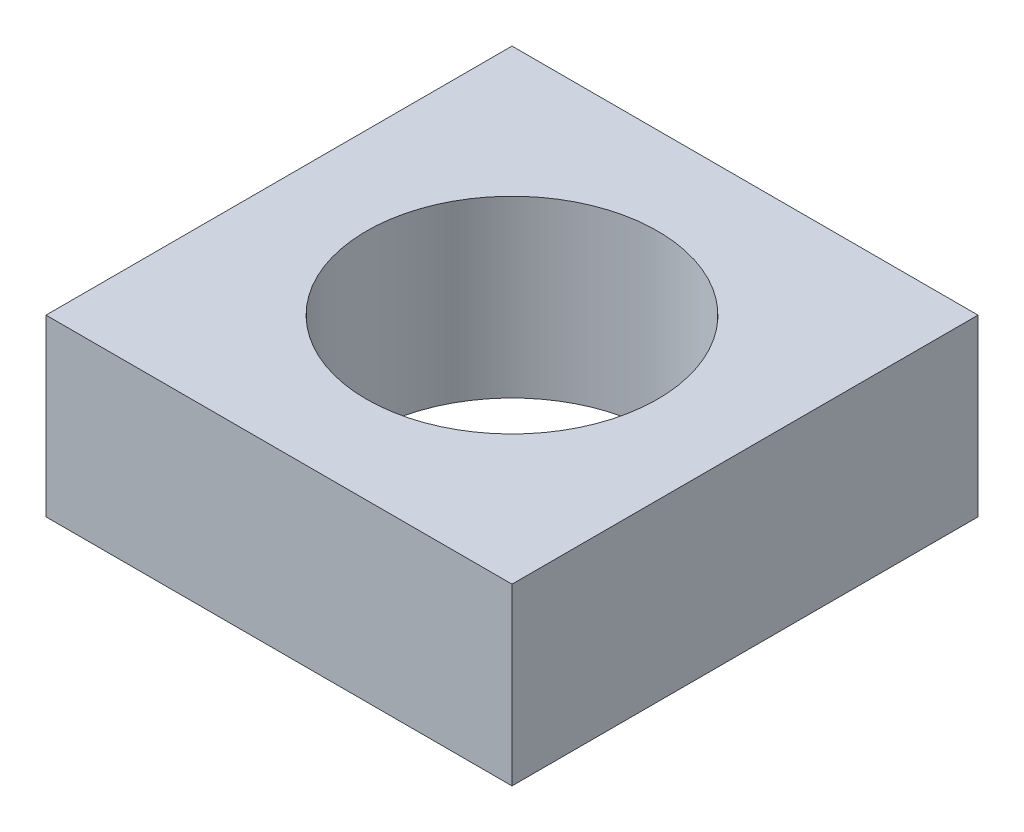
from build123d import *

# Parameters (mm, degrees)
SKETCH1_W           = 8
SKETCH1_H           = 8
SKETCH1_R           = 2.5
ORIGINAL_PART_DEPTH = 3


with BuildPart() as part:
    # Sketch1 → Original Part (new body)
    with BuildSketch(Plane(origin=(0, 0, 0), x_dir=(1, 0, 0), z_dir=(0, 1, 0))):
        with Locations((4, 4)):
            Rectangle(SKETCH1_W, SKETCH1_H)
        with Locations(Location((4, 4, 0), (0, 0, 270))):
            Circle(SKETCH1_R, mode=Mode.SUBTRACT)
    extrude(amount=ORIGINAL_PART_DEPTH)


solid = part.part
